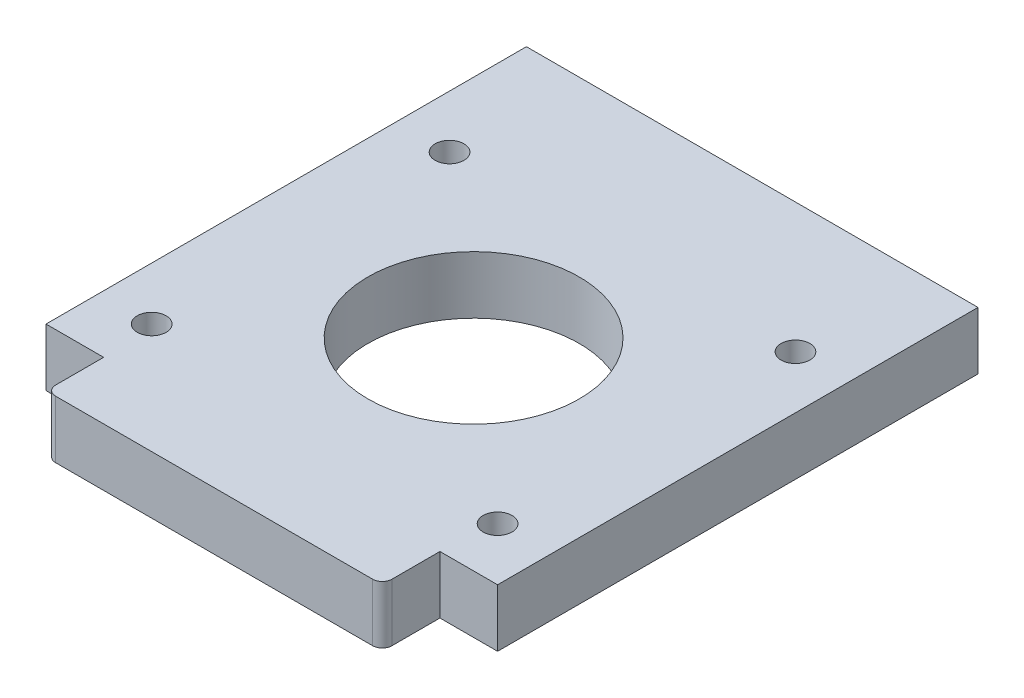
from build123d import *

# Parameters (mm, degrees)
SKETCH1_R           = 11
SKETCH1_R_2         = 1.5
BOSS_EXTRUDE1_DEPTH = 6
FILLET1_R           = 1


with BuildPart() as part:
    # Sketch1 → Boss-Extrude1 (new body)
    with BuildSketch(Plane(origin=(0, 0, 0), x_dir=(1, 0, 0), z_dir=(0, 1, 0))):
        Polygon((-17.5, -21), (-17.5, -27), (17.5, -27), (17.5, -21), (23.5, -21), (23.5, 21), (23.5, 29), (-23.5, 29), (-23.5, 21), (-23.5, -21), align=None)
        with Locations(Location((0, 0, 0), (0, 0, 270))):
            Circle(SKETCH1_R, mode=Mode.SUBTRACT)
        with Locations(Location((-18, -15.5, 0), (0, 0, 270))):
            Circle(SKETCH1_R_2, mode=Mode.SUBTRACT)
        with Locations(Location((18, -15.5, 0), (0, 0, 90))):
            Circle(SKETCH1_R_2, mode=Mode.SUBTRACT)
        with Locations(Location((18, 15.5, 0), (0, 0, 270))):
            Circle(SKETCH1_R_2, mode=Mode.SUBTRACT)
        with Locations(Location((-18, 15.5, 0), (0, 0, 90))):
            Circle(SKETCH1_R_2, mode=Mode.SUBTRACT)
    extrude(amount=BOSS_EXTRUDE1_DEPTH)

    # Fillet1
    fillet1_edges = [part.edges().sort_by_distance(p)[0] for p in [
        (17.5, 3, 27),
        (-17.5, 3, 27),
    ]]
    fillet(fillet1_edges, radius=FILLET1_R)


solid = part.part
